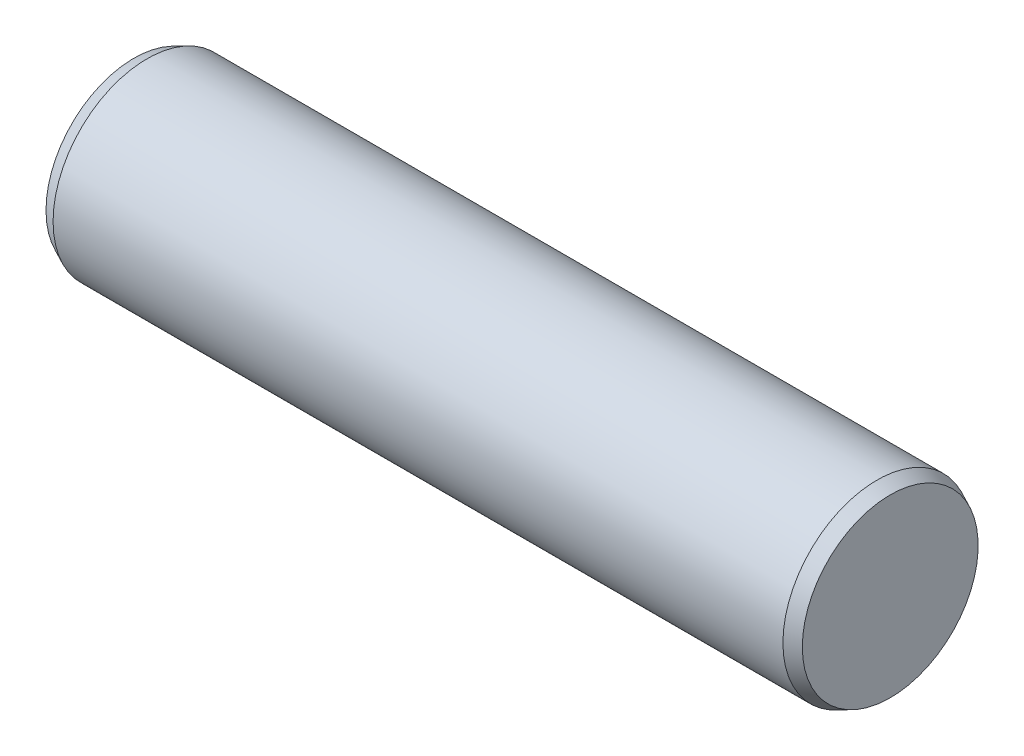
from build123d import *


with BuildPart() as part:
    # Sketch1 → Base-Revolve (revolve)
    with BuildSketch(Plane.XY, mode=Mode.PRIVATE) as base_revolve_sk:
        Polygon((0, 0), (101.6, 0), (101.6, 11.809944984), (99.822, 12.63904), (1.778, 12.63904), (0, 11.809944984), align=None)
    revolve(base_revolve_sk.sketch.rotate(Axis((-6.35, 0, 0), (1, 0, 0)), 90), axis=Axis((-6.35, 0, 0), (1, 0, 0)))


solid = part.part
